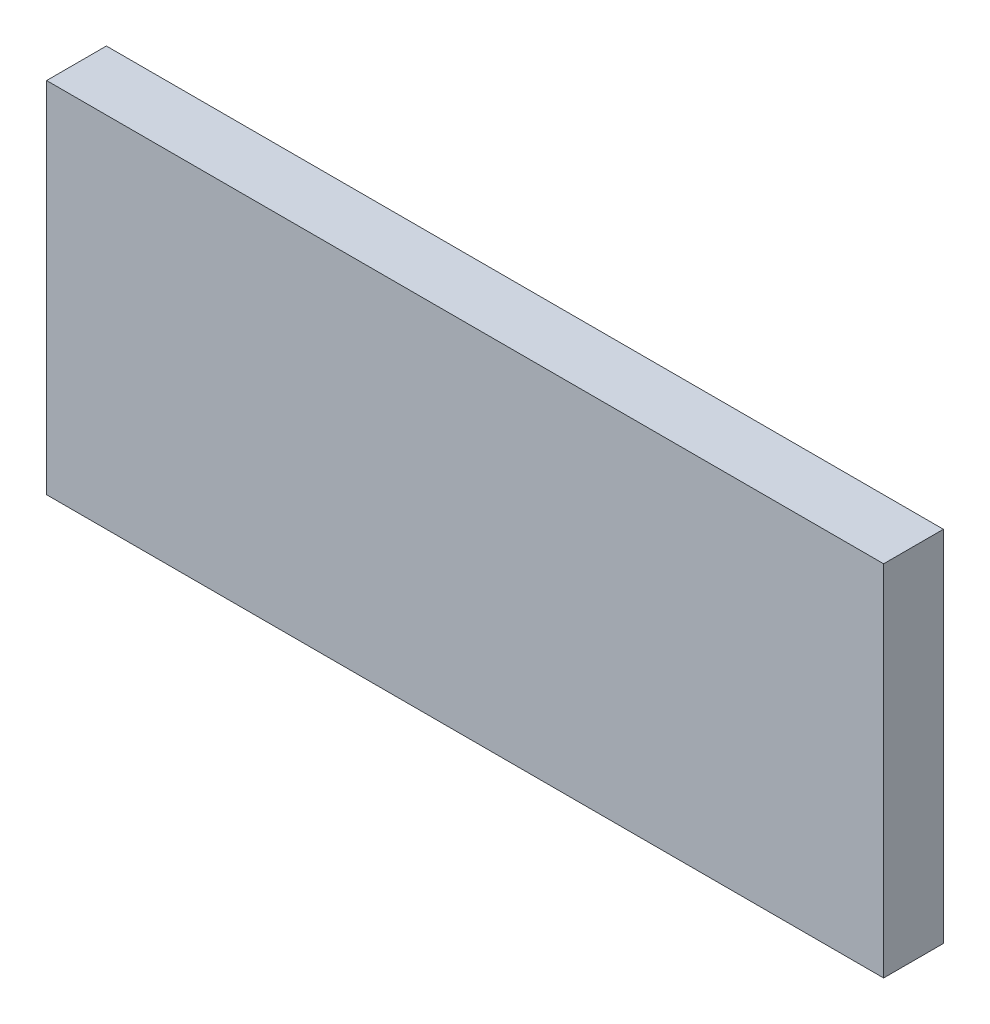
from build123d import *

# Parameters (mm, degrees)
SKETCH1_W      = 177.8
SKETCH1_H      = 76.2
EXTRUDE1_DEPTH = 12.7


with BuildPart() as part:
    # Sketch1 → Extrude1 (new body)
    with BuildSketch(Plane.XY):
        with Locations((88.9, 38.1)):
            Rectangle(SKETCH1_W, SKETCH1_H)
    extrude(amount=EXTRUDE1_DEPTH)


solid = part.part
